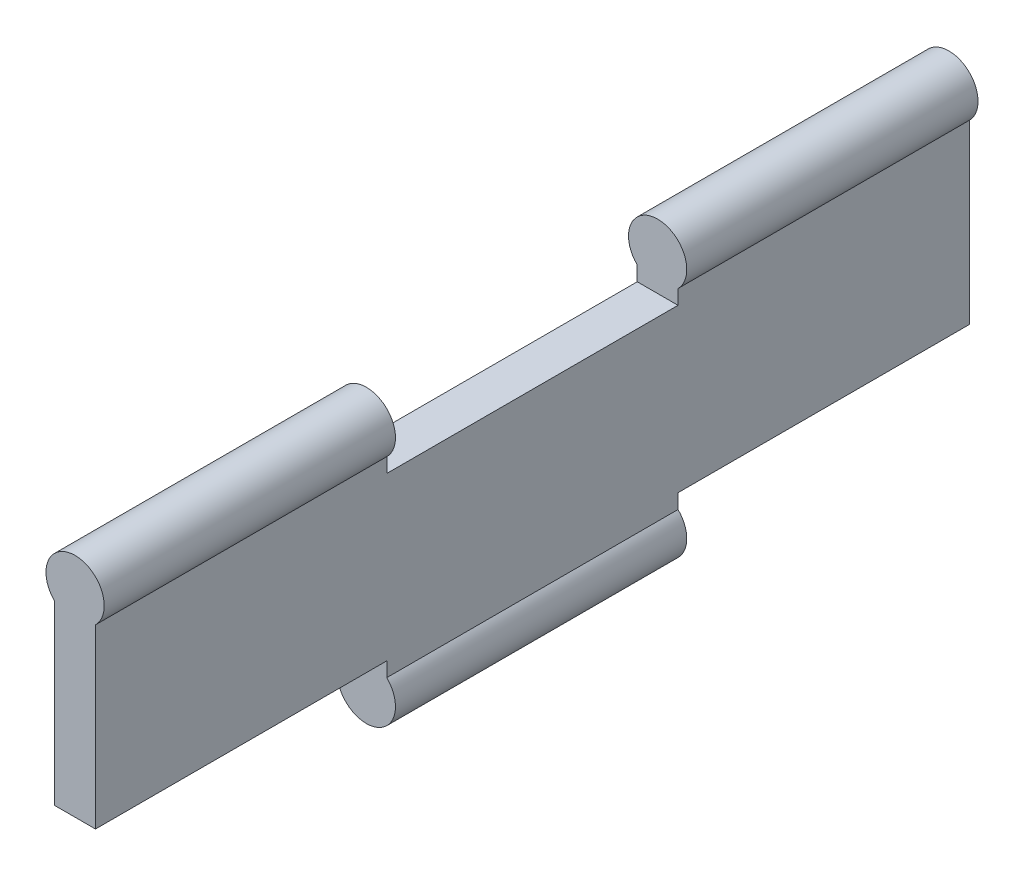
ISO-10303-21;
HEADER;
FILE_DESCRIPTION(('STEP AP214'),'2;1');
FILE_NAME('part.step','',(''),(''),'','','');
FILE_SCHEMA(('AUTOMOTIVE_DESIGN { 1 0 10303 214 1 1 1 1 }'));
ENDSEC;
DATA;
#1=APPLICATION_CONTEXT('core data for automotive mechanical design processes');
#2=APPLICATION_PROTOCOL_DEFINITION('international standard','automotive_design',2000,#1);
#3=PRODUCT_CONTEXT('',#1,'mechanical');
#4=PRODUCT('Part','Part','',(#3));
#5=PRODUCT_RELATED_PRODUCT_CATEGORY('part','',(#4));
#6=PRODUCT_DEFINITION_FORMATION('','',#4);
#7=PRODUCT_DEFINITION_CONTEXT('part definition',#1,'design');
#8=PRODUCT_DEFINITION('design','',#6,#7);
#9=PRODUCT_DEFINITION_SHAPE('','',#8);
#10=(LENGTH_UNIT() NAMED_UNIT(*) SI_UNIT(.MILLI.,.METRE.));
#11=(NAMED_UNIT(*) PLANE_ANGLE_UNIT() SI_UNIT($,.RADIAN.));
#12=(NAMED_UNIT(*) SI_UNIT($,.STERADIAN.) SOLID_ANGLE_UNIT());
#13=UNCERTAINTY_MEASURE_WITH_UNIT(LENGTH_MEASURE(1.E-05),#10,'distance_accuracy_value','');
#14=(GEOMETRIC_REPRESENTATION_CONTEXT(3) GLOBAL_UNCERTAINTY_ASSIGNED_CONTEXT((#13)) GLOBAL_UNIT_ASSIGNED_CONTEXT((#10,
#11,#12)) REPRESENTATION_CONTEXT('',''));
#15=CARTESIAN_POINT('',(0.,0.,0.));
#16=DIRECTION('',(0.,0.,1.));
#17=DIRECTION('',(1.,0.,0.));
#18=AXIS2_PLACEMENT_3D('',#15,#16,#17);
#19=CARTESIAN_POINT('',(6.99999999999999,72.8585715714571,300.));
#20=DIRECTION('',(-1.,0.,0.));
#21=DIRECTION('',(0.,-1.,0.));
#22=AXIS2_PLACEMENT_3D('',#19,#20,#21);
#23=PLANE('',#22);
#24=DIRECTION('',(0.,-1.,0.));
#25=VECTOR('',#24,1.);
#26=CARTESIAN_POINT('',(6.99999999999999,72.8585715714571,99.9999999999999));
#27=LINE('',#26,#25);
#28=CARTESIAN_POINT('',(6.99999999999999,12.1414284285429,99.9999999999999));
#29=VERTEX_POINT('',#28);
#30=CARTESIAN_POINT('',(7.,7.14142842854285,99.9999999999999));
#31=VERTEX_POINT('',#30);
#32=EDGE_CURVE('E134',#29,#31,#27,.T.);
#33=ORIENTED_EDGE('',*,*,#32,.F.);
#34=DIRECTION('',(0.,0.,1.));
#35=VECTOR('',#34,1.);
#36=CARTESIAN_POINT('',(7.,12.1414284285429,300.));
#37=LINE('',#36,#35);
#38=CARTESIAN_POINT('',(7.,12.1414284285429,0.));
#39=VERTEX_POINT('',#38);
#40=EDGE_CURVE('E123',#39,#29,#37,.T.);
#41=ORIENTED_EDGE('',*,*,#40,.F.);
#42=DIRECTION('',(0.,1.,0.));
#43=VECTOR('',#42,1.);
#44=CARTESIAN_POINT('',(6.99999999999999,72.8585715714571,0.));
#45=LINE('',#44,#43);
#46=CARTESIAN_POINT('',(6.99999999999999,72.8585715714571,0.));
#47=VERTEX_POINT('',#46);
#48=EDGE_CURVE('E170',#39,#47,#45,.T.);
#49=ORIENTED_EDGE('',*,*,#48,.T.);
#50=DIRECTION('',(0.,0.,-1.));
#51=VECTOR('',#50,1.);
#52=CARTESIAN_POINT('',(6.99999999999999,72.8585715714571,300.));
#53=LINE('',#52,#51);
#54=CARTESIAN_POINT('',(6.99999999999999,72.8585715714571,99.9999999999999));
#55=VERTEX_POINT('',#54);
#56=EDGE_CURVE('E192',#55,#47,#53,.T.);
#57=ORIENTED_EDGE('',*,*,#56,.F.);
#58=DIRECTION('',(0.,1.,0.));
#59=VECTOR('',#58,1.);
#60=CARTESIAN_POINT('',(6.99999999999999,72.8585715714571,99.9999999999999));
#61=LINE('',#60,#59);
#62=CARTESIAN_POINT('',(6.99999999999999,67.8585715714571,99.9999999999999));
#63=VERTEX_POINT('',#62);
#64=EDGE_CURVE('E168',#63,#55,#61,.T.);
#65=ORIENTED_EDGE('',*,*,#64,.F.);
#66=DIRECTION('',(0.,0.,-1.));
#67=VECTOR('',#66,1.);
#68=CARTESIAN_POINT('',(6.99999999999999,67.8585715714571,300.));
#69=LINE('',#68,#67);
#70=CARTESIAN_POINT('',(6.99999999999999,67.8585715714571,200.));
#71=VERTEX_POINT('',#70);
#72=EDGE_CURVE('E160',#71,#63,#69,.T.);
#73=ORIENTED_EDGE('',*,*,#72,.F.);
#74=DIRECTION('',(0.,-1.,0.));
#75=VECTOR('',#74,1.);
#76=CARTESIAN_POINT('',(6.99999999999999,72.8585715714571,200.));
#77=LINE('',#76,#75);
#78=CARTESIAN_POINT('',(6.99999999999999,72.8585715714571,200.));
#79=VERTEX_POINT('',#78);
#80=EDGE_CURVE('E164',#79,#71,#77,.T.);
#81=ORIENTED_EDGE('',*,*,#80,.F.);
#82=CARTESIAN_POINT('',(6.99999999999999,72.8585715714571,300.));
#83=VERTEX_POINT('',#82);
#84=EDGE_CURVE('E193',#83,#79,#53,.T.);
#85=ORIENTED_EDGE('',*,*,#84,.F.);
#86=DIRECTION('',(0.,1.,0.));
#87=VECTOR('',#86,1.);
#88=CARTESIAN_POINT('',(6.99999999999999,72.8585715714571,300.));
#89=LINE('',#88,#87);
#90=CARTESIAN_POINT('',(7.,12.1414284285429,300.));
#91=VERTEX_POINT('',#90);
#92=EDGE_CURVE('E171',#91,#83,#89,.T.);
#93=ORIENTED_EDGE('',*,*,#92,.F.);
#94=DIRECTION('',(0.,0.,1.));
#95=VECTOR('',#94,1.);
#96=CARTESIAN_POINT('',(7.,12.1414284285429,300.));
#97=LINE('',#96,#95);
#98=CARTESIAN_POINT('',(6.99999999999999,12.1414284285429,200.));
#99=VERTEX_POINT('',#98);
#100=EDGE_CURVE('E58',#99,#91,#97,.T.);
#101=ORIENTED_EDGE('',*,*,#100,.F.);
#102=DIRECTION('',(0.,1.,0.));
#103=VECTOR('',#102,1.);
#104=CARTESIAN_POINT('',(6.99999999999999,72.8585715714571,200.));
#105=LINE('',#104,#103);
#106=CARTESIAN_POINT('',(7.,7.14142842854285,200.));
#107=VERTEX_POINT('',#106);
#108=EDGE_CURVE('E153',#107,#99,#105,.T.);
#109=ORIENTED_EDGE('',*,*,#108,.F.);
#110=DIRECTION('',(0.,0.,-1.));
#111=VECTOR('',#110,1.);
#112=CARTESIAN_POINT('',(7.,7.14142842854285,300.));
#113=LINE('',#112,#111);
#114=EDGE_CURVE('E141',#107,#31,#113,.T.);
#115=ORIENTED_EDGE('',*,*,#114,.T.);
#116=EDGE_LOOP('',(#33,#41,#49,#57,#65,#73,#81,#85,#93,#101,#109,#115));
#117=FACE_BOUND('',#116,.T.);
#118=ADVANCED_FACE('F35',(#117),#23,.F.);
#119=CARTESIAN_POINT('',(-7.00000000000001,72.8585715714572,300.));
#120=DIRECTION('',(1.,0.,0.));
#121=DIRECTION('',(0.,1.,0.));
#122=AXIS2_PLACEMENT_3D('',#119,#120,#121);
#123=PLANE('',#122);
#124=DIRECTION('',(0.,1.,0.));
#125=VECTOR('',#124,1.);
#126=CARTESIAN_POINT('',(-7.00000000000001,72.8585715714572,99.9999999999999));
#127=LINE('',#126,#125);
#128=CARTESIAN_POINT('',(-7.,7.14142842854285,99.9999999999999));
#129=VERTEX_POINT('',#128);
#130=CARTESIAN_POINT('',(-7.00000000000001,12.1414284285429,99.9999999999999));
#131=VERTEX_POINT('',#130);
#132=EDGE_CURVE('E130',#129,#131,#127,.T.);
#133=ORIENTED_EDGE('',*,*,#132,.F.);
#134=DIRECTION('',(0.,0.,-1.));
#135=VECTOR('',#134,1.);
#136=CARTESIAN_POINT('',(-7.,7.14142842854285,300.));
#137=LINE('',#136,#135);
#138=CARTESIAN_POINT('',(-7.,7.14142842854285,200.));
#139=VERTEX_POINT('',#138);
#140=EDGE_CURVE('E179',#139,#129,#137,.T.);
#141=ORIENTED_EDGE('',*,*,#140,.F.);
#142=DIRECTION('',(0.,-1.,0.));
#143=VECTOR('',#142,1.);
#144=CARTESIAN_POINT('',(-7.00000000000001,72.8585715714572,200.));
#145=LINE('',#144,#143);
#146=CARTESIAN_POINT('',(-7.00000000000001,12.1414284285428,200.));
#147=VERTEX_POINT('',#146);
#148=EDGE_CURVE('E151',#147,#139,#145,.T.);
#149=ORIENTED_EDGE('',*,*,#148,.F.);
#150=DIRECTION('',(0.,0.,-1.));
#151=VECTOR('',#150,1.);
#152=CARTESIAN_POINT('',(-7.,12.1414284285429,300.));
#153=LINE('',#152,#151);
#154=CARTESIAN_POINT('',(-7.00000000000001,12.1414284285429,300.));
#155=VERTEX_POINT('',#154);
#156=EDGE_CURVE('E145',#155,#147,#153,.T.);
#157=ORIENTED_EDGE('',*,*,#156,.F.);
#158=DIRECTION('',(0.,-1.,0.));
#159=VECTOR('',#158,1.);
#160=CARTESIAN_POINT('',(-7.00000000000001,72.8585715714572,300.));
#161=LINE('',#160,#159);
#162=CARTESIAN_POINT('',(-7.00000000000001,72.8585715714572,300.));
#163=VERTEX_POINT('',#162);
#164=EDGE_CURVE('E176',#163,#155,#161,.T.);
#165=ORIENTED_EDGE('',*,*,#164,.F.);
#166=DIRECTION('',(0.,0.,-1.));
#167=VECTOR('',#166,1.);
#168=CARTESIAN_POINT('',(-7.00000000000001,72.8585715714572,300.));
#169=LINE('',#168,#167);
#170=CARTESIAN_POINT('',(-7.00000000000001,72.8585715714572,200.));
#171=VERTEX_POINT('',#170);
#172=EDGE_CURVE('E189',#163,#171,#169,.T.);
#173=ORIENTED_EDGE('',*,*,#172,.T.);
#174=DIRECTION('',(0.,1.,0.));
#175=VECTOR('',#174,1.);
#176=CARTESIAN_POINT('',(-7.00000000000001,72.8585715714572,200.));
#177=LINE('',#176,#175);
#178=CARTESIAN_POINT('',(-7.00000000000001,67.8585715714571,200.));
#179=VERTEX_POINT('',#178);
#180=EDGE_CURVE('E199',#179,#171,#177,.T.);
#181=ORIENTED_EDGE('',*,*,#180,.F.);
#182=DIRECTION('',(0.,0.,1.));
#183=VECTOR('',#182,1.);
#184=CARTESIAN_POINT('',(-7.00000000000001,67.8585715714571,300.));
#185=LINE('',#184,#183);
#186=CARTESIAN_POINT('',(-7.00000000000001,67.8585715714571,99.9999999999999));
#187=VERTEX_POINT('',#186);
#188=EDGE_CURVE('E197',#187,#179,#185,.T.);
#189=ORIENTED_EDGE('',*,*,#188,.F.);
#190=DIRECTION('',(0.,-1.,0.));
#191=VECTOR('',#190,1.);
#192=CARTESIAN_POINT('',(-7.00000000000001,72.8585715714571,99.9999999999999));
#193=LINE('',#192,#191);
#194=CARTESIAN_POINT('',(-7.00000000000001,72.8585715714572,99.9999999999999));
#195=VERTEX_POINT('',#194);
#196=EDGE_CURVE('E201',#195,#187,#193,.T.);
#197=ORIENTED_EDGE('',*,*,#196,.F.);
#198=CARTESIAN_POINT('',(-7.00000000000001,72.8585715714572,0.));
#199=VERTEX_POINT('',#198);
#200=EDGE_CURVE('E188',#195,#199,#169,.T.);
#201=ORIENTED_EDGE('',*,*,#200,.T.);
#202=DIRECTION('',(0.,-1.,0.));
#203=VECTOR('',#202,1.);
#204=CARTESIAN_POINT('',(-7.00000000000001,72.8585715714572,0.));
#205=LINE('',#204,#203);
#206=CARTESIAN_POINT('',(-7.,12.1414284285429,0.));
#207=VERTEX_POINT('',#206);
#208=EDGE_CURVE('E174',#199,#207,#205,.T.);
#209=ORIENTED_EDGE('',*,*,#208,.T.);
#210=DIRECTION('',(0.,0.,-1.));
#211=VECTOR('',#210,1.);
#212=CARTESIAN_POINT('',(-7.,12.1414284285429,300.));
#213=LINE('',#212,#211);
#214=EDGE_CURVE('E50',#131,#207,#213,.T.);
#215=ORIENTED_EDGE('',*,*,#214,.F.);
#216=EDGE_LOOP('',(#133,#141,#149,#157,#165,#173,#181,#189,#197,#201,#209,#215));
#217=FACE_BOUND('',#216,.T.);
#218=ADVANCED_FACE('F215',(#217),#123,.F.);
#219=CARTESIAN_POINT('',(0.,0.,300.));
#220=DIRECTION('',(0.,0.,-1.));
#221=DIRECTION('',(-1.,0.,0.));
#222=AXIS2_PLACEMENT_3D('',#219,#220,#221);
#223=CYLINDRICAL_SURFACE('',#222,10.);
#224=CARTESIAN_POINT('',(0.,0.,99.9999999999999));
#225=DIRECTION('',(0.,0.,-1.));
#226=DIRECTION('',(-1.,0.,0.));
#227=AXIS2_PLACEMENT_3D('',#224,#225,#226);
#228=CIRCLE('',#227,10.);
#229=EDGE_CURVE('E11',#31,#129,#228,.T.);
#230=ORIENTED_EDGE('',*,*,#229,.F.);
#231=ORIENTED_EDGE('',*,*,#114,.F.);
#232=CARTESIAN_POINT('',(0.,0.,200.));
#233=DIRECTION('',(0.,0.,1.));
#234=DIRECTION('',(1.,0.,0.));
#235=AXIS2_PLACEMENT_3D('',#232,#233,#234);
#236=CIRCLE('',#235,10.);
#237=EDGE_CURVE('E206',#139,#107,#236,.T.);
#238=ORIENTED_EDGE('',*,*,#237,.F.);
#239=ORIENTED_EDGE('',*,*,#140,.T.);
#240=EDGE_LOOP('',(#230,#231,#238,#239));
#241=FACE_BOUND('',#240,.T.);
#242=ADVANCED_FACE('F37',(#241),#223,.T.);
#243=CARTESIAN_POINT('',(0.,0.,0.));
#244=DIRECTION('',(0.,0.,1.));
#245=DIRECTION('',(1.,0.,0.));
#246=AXIS2_PLACEMENT_3D('',#243,#244,#245);
#247=PLANE('',#246);
#248=DIRECTION('',(1.,0.,0.));
#249=VECTOR('',#248,1.);
#250=CARTESIAN_POINT('',(0.,12.1414284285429,0.));
#251=LINE('',#250,#249);
#252=EDGE_CURVE('E43',#207,#39,#251,.T.);
#253=ORIENTED_EDGE('',*,*,#252,.F.);
#254=ORIENTED_EDGE('',*,*,#208,.F.);
#255=CARTESIAN_POINT('',(0.,80.,0.));
#256=DIRECTION('',(0.,0.,1.));
#257=DIRECTION('',(1.,0.,0.));
#258=AXIS2_PLACEMENT_3D('',#255,#256,#257);
#259=CIRCLE('',#258,10.);
#260=EDGE_CURVE('E181',#47,#199,#259,.T.);
#261=ORIENTED_EDGE('',*,*,#260,.F.);
#262=ORIENTED_EDGE('',*,*,#48,.F.);
#263=EDGE_LOOP('',(#253,#254,#261,#262));
#264=FACE_BOUND('',#263,.T.);
#265=ADVANCED_FACE('F222',(#264),#247,.F.);
#266=CARTESIAN_POINT('',(0.,0.,300.));
#267=DIRECTION('',(0.,0.,1.));
#268=DIRECTION('',(1.,0.,0.));
#269=AXIS2_PLACEMENT_3D('',#266,#267,#268);
#270=PLANE('',#269);
#271=ORIENTED_EDGE('',*,*,#164,.T.);
#272=DIRECTION('',(1.,0.,0.));
#273=VECTOR('',#272,1.);
#274=CARTESIAN_POINT('',(0.,12.1414284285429,300.));
#275=LINE('',#274,#273);
#276=EDGE_CURVE('E204',#155,#91,#275,.T.);
#277=ORIENTED_EDGE('',*,*,#276,.T.);
#278=ORIENTED_EDGE('',*,*,#92,.T.);
#279=CARTESIAN_POINT('',(0.,80.,300.));
#280=DIRECTION('',(0.,0.,1.));
#281=DIRECTION('',(1.,0.,0.));
#282=AXIS2_PLACEMENT_3D('',#279,#280,#281);
#283=CIRCLE('',#282,10.);
#284=EDGE_CURVE('E173',#83,#163,#283,.T.);
#285=ORIENTED_EDGE('',*,*,#284,.T.);
#286=EDGE_LOOP('',(#271,#277,#278,#285));
#287=FACE_BOUND('',#286,.T.);
#288=ADVANCED_FACE('F249',(#287),#270,.T.);
#289=CARTESIAN_POINT('',(0.,80.,300.));
#290=DIRECTION('',(0.,0.,-1.));
#291=DIRECTION('',(-1.,0.,0.));
#292=AXIS2_PLACEMENT_3D('',#289,#290,#291);
#293=CYLINDRICAL_SURFACE('',#292,10.);
#294=CARTESIAN_POINT('',(0.,80.,99.9999999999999));
#295=DIRECTION('',(0.,0.,1.));
#296=DIRECTION('',(0.,-1.,0.));
#297=AXIS2_PLACEMENT_3D('',#294,#295,#296);
#298=CIRCLE('',#297,10.);
#299=EDGE_CURVE('E166',#55,#195,#298,.T.);
#300=ORIENTED_EDGE('',*,*,#299,.F.);
#301=ORIENTED_EDGE('',*,*,#56,.T.);
#302=ORIENTED_EDGE('',*,*,#260,.T.);
#303=ORIENTED_EDGE('',*,*,#200,.F.);
#304=EDGE_LOOP('',(#300,#301,#302,#303));
#305=FACE_BOUND('',#304,.T.);
#306=ADVANCED_FACE('F228',(#305),#293,.T.);
#307=CARTESIAN_POINT('',(0.,80.,200.));
#308=DIRECTION('',(0.,0.,-1.));
#309=DIRECTION('',(-1.,0.,0.));
#310=AXIS2_PLACEMENT_3D('',#307,#308,#309);
#311=CIRCLE('',#310,10.);
#312=EDGE_CURVE('E162',#171,#79,#311,.T.);
#313=ORIENTED_EDGE('',*,*,#312,.F.);
#314=ORIENTED_EDGE('',*,*,#172,.F.);
#315=ORIENTED_EDGE('',*,*,#284,.F.);
#316=ORIENTED_EDGE('',*,*,#84,.T.);
#317=EDGE_LOOP('',(#313,#314,#315,#316));
#318=FACE_BOUND('',#317,.T.);
#319=ADVANCED_FACE('F245',(#318),#293,.T.);
#320=CARTESIAN_POINT('',(82.,112.141428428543,99.9999999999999));
#321=DIRECTION('',(0.,0.,1.));
#322=DIRECTION('',(0.,-1.,0.));
#323=AXIS2_PLACEMENT_3D('',#320,#321,#322);
#324=PLANE('',#323);
#325=ORIENTED_EDGE('',*,*,#64,.T.);
#326=ORIENTED_EDGE('',*,*,#299,.T.);
#327=ORIENTED_EDGE('',*,*,#196,.T.);
#328=DIRECTION('',(-1.,0.,0.));
#329=VECTOR('',#328,1.);
#330=CARTESIAN_POINT('',(82.,67.8585715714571,99.9999999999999));
#331=LINE('',#330,#329);
#332=EDGE_CURVE('E155',#63,#187,#331,.T.);
#333=ORIENTED_EDGE('',*,*,#332,.F.);
#334=EDGE_LOOP('',(#325,#326,#327,#333));
#335=FACE_BOUND('',#334,.T.);
#336=ADVANCED_FACE('F230',(#335),#324,.T.);
#337=CARTESIAN_POINT('',(82.,112.141428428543,200.));
#338=DIRECTION('',(0.,0.,-1.));
#339=DIRECTION('',(-1.,0.,0.));
#340=AXIS2_PLACEMENT_3D('',#337,#338,#339);
#341=PLANE('',#340);
#342=ORIENTED_EDGE('',*,*,#80,.T.);
#343=DIRECTION('',(-1.,0.,0.));
#344=VECTOR('',#343,1.);
#345=CARTESIAN_POINT('',(82.,67.8585715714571,200.));
#346=LINE('',#345,#344);
#347=EDGE_CURVE('E157',#71,#179,#346,.T.);
#348=ORIENTED_EDGE('',*,*,#347,.T.);
#349=ORIENTED_EDGE('',*,*,#180,.T.);
#350=ORIENTED_EDGE('',*,*,#312,.T.);
#351=EDGE_LOOP('',(#342,#348,#349,#350));
#352=FACE_BOUND('',#351,.T.);
#353=ADVANCED_FACE('F239',(#352),#341,.T.);
#354=CARTESIAN_POINT('',(82.,67.8585715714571,200.));
#355=DIRECTION('',(0.,1.,0.));
#356=DIRECTION('',(-1.,0.,0.));
#357=AXIS2_PLACEMENT_3D('',#354,#355,#356);
#358=PLANE('',#357);
#359=ORIENTED_EDGE('',*,*,#72,.T.);
#360=ORIENTED_EDGE('',*,*,#332,.T.);
#361=ORIENTED_EDGE('',*,*,#188,.T.);
#362=ORIENTED_EDGE('',*,*,#347,.F.);
#363=EDGE_LOOP('',(#359,#360,#361,#362));
#364=FACE_BOUND('',#363,.T.);
#365=ADVANCED_FACE('F236',(#364),#358,.T.);
#366=CARTESIAN_POINT('',(82.,-32.1414284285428,200.));
#367=DIRECTION('',(0.,0.,1.));
#368=DIRECTION('',(1.,0.,0.));
#369=AXIS2_PLACEMENT_3D('',#366,#367,#368);
#370=PLANE('',#369);
#371=ORIENTED_EDGE('',*,*,#108,.T.);
#372=DIRECTION('',(-1.,0.,0.));
#373=VECTOR('',#372,1.);
#374=CARTESIAN_POINT('',(82.,12.1414284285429,200.));
#375=LINE('',#374,#373);
#376=EDGE_CURVE('E142',#99,#147,#375,.T.);
#377=ORIENTED_EDGE('',*,*,#376,.T.);
#378=ORIENTED_EDGE('',*,*,#148,.T.);
#379=ORIENTED_EDGE('',*,*,#237,.T.);
#380=EDGE_LOOP('',(#371,#377,#378,#379));
#381=FACE_BOUND('',#380,.T.);
#382=ADVANCED_FACE('F209',(#381),#370,.T.);
#383=CARTESIAN_POINT('',(82.,12.1414284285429,338.842705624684));
#384=DIRECTION('',(0.,-1.,0.));
#385=DIRECTION('',(1.,0.,0.));
#386=AXIS2_PLACEMENT_3D('',#383,#384,#385);
#387=PLANE('',#386);
#388=ORIENTED_EDGE('',*,*,#100,.T.);
#389=ORIENTED_EDGE('',*,*,#276,.F.);
#390=ORIENTED_EDGE('',*,*,#156,.T.);
#391=ORIENTED_EDGE('',*,*,#376,.F.);
#392=EDGE_LOOP('',(#388,#389,#390,#391));
#393=FACE_BOUND('',#392,.T.);
#394=ADVANCED_FACE('F251',(#393),#387,.T.);
#395=CARTESIAN_POINT('',(82.,-32.1414284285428,99.9999999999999));
#396=DIRECTION('',(0.,0.,-1.));
#397=DIRECTION('',(-1.,0.,0.));
#398=AXIS2_PLACEMENT_3D('',#395,#396,#397);
#399=PLANE('',#398);
#400=ORIENTED_EDGE('',*,*,#32,.T.);
#401=ORIENTED_EDGE('',*,*,#229,.T.);
#402=ORIENTED_EDGE('',*,*,#132,.T.);
#403=DIRECTION('',(-1.,0.,0.));
#404=VECTOR('',#403,1.);
#405=CARTESIAN_POINT('',(82.,12.1414284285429,99.9999999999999));
#406=LINE('',#405,#404);
#407=EDGE_CURVE('E126',#29,#131,#406,.T.);
#408=ORIENTED_EDGE('',*,*,#407,.F.);
#409=EDGE_LOOP('',(#400,#401,#402,#408));
#410=FACE_BOUND('',#409,.T.);
#411=ADVANCED_FACE('F133',(#410),#399,.T.);
#412=CARTESIAN_POINT('',(82.,12.1414284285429,-11.2523648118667));
#413=DIRECTION('',(0.,-1.,0.));
#414=DIRECTION('',(1.,0.,0.));
#415=AXIS2_PLACEMENT_3D('',#412,#413,#414);
#416=PLANE('',#415);
#417=ORIENTED_EDGE('',*,*,#40,.T.);
#418=ORIENTED_EDGE('',*,*,#407,.T.);
#419=ORIENTED_EDGE('',*,*,#214,.T.);
#420=ORIENTED_EDGE('',*,*,#252,.T.);
#421=EDGE_LOOP('',(#417,#418,#419,#420));
#422=FACE_BOUND('',#421,.T.);
#423=ADVANCED_FACE('F125',(#422),#416,.T.);
#424=CLOSED_SHELL('',(#118,#218,#242,#265,#288,#306,#319,#336,#353,#365,#382,#394,#411,#423));
#425=MANIFOLD_SOLID_BREP('B2',#424);
#426=ADVANCED_BREP_SHAPE_REPRESENTATION('',(#18,#425),#14);
#427=SHAPE_DEFINITION_REPRESENTATION(#9,#426);
ENDSEC;
END-ISO-10303-21;
